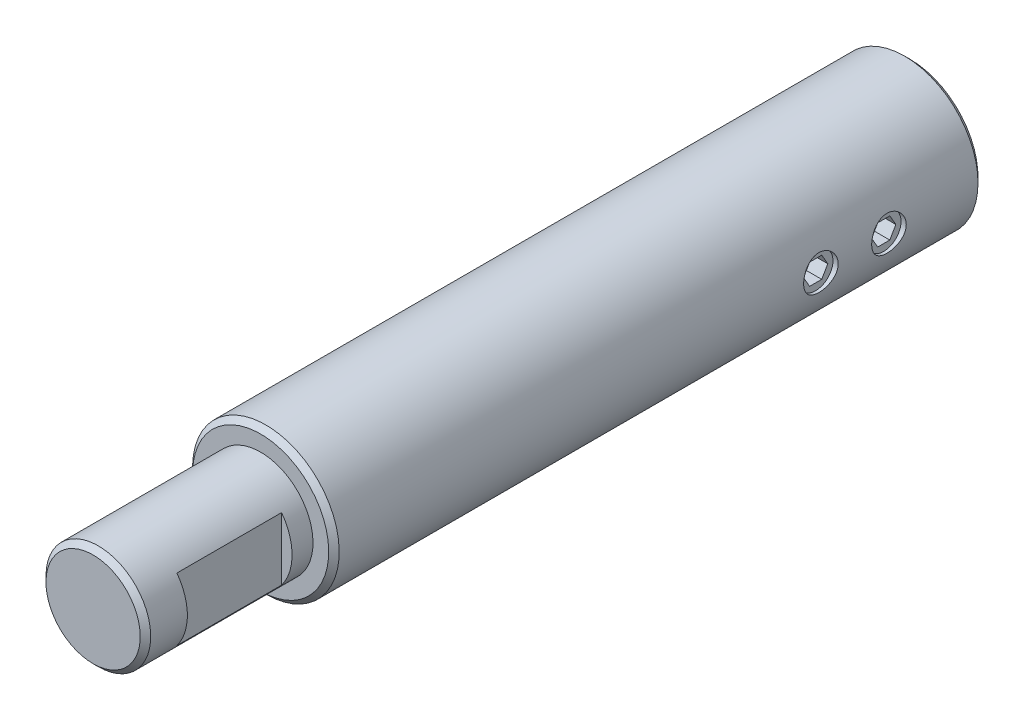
ISO-10303-21;
HEADER;
FILE_DESCRIPTION(('STEP AP214'),'2;1');
FILE_NAME('part.step','',(''),(''),'','','');
FILE_SCHEMA(('AUTOMOTIVE_DESIGN { 1 0 10303 214 1 1 1 1 }'));
ENDSEC;
DATA;
#1=APPLICATION_CONTEXT('core data for automotive mechanical design processes');
#2=APPLICATION_PROTOCOL_DEFINITION('international standard','automotive_design',2000,#1);
#3=PRODUCT_CONTEXT('',#1,'mechanical');
#4=PRODUCT('Part','Part','',(#3));
#5=PRODUCT_RELATED_PRODUCT_CATEGORY('part','',(#4));
#6=PRODUCT_DEFINITION_FORMATION('','',#4);
#7=PRODUCT_DEFINITION_CONTEXT('part definition',#1,'design');
#8=PRODUCT_DEFINITION('design','',#6,#7);
#9=PRODUCT_DEFINITION_SHAPE('','',#8);
#10=(LENGTH_UNIT() NAMED_UNIT(*) SI_UNIT(.MILLI.,.METRE.));
#11=(NAMED_UNIT(*) PLANE_ANGLE_UNIT() SI_UNIT($,.RADIAN.));
#12=(NAMED_UNIT(*) SI_UNIT($,.STERADIAN.) SOLID_ANGLE_UNIT());
#13=UNCERTAINTY_MEASURE_WITH_UNIT(LENGTH_MEASURE(1.E-05),#10,'distance_accuracy_value','');
#14=(GEOMETRIC_REPRESENTATION_CONTEXT(3) GLOBAL_UNCERTAINTY_ASSIGNED_CONTEXT((#13)) GLOBAL_UNIT_ASSIGNED_CONTEXT((#10,
#11,#12)) REPRESENTATION_CONTEXT('',''));
#15=CARTESIAN_POINT('',(0.,0.,0.));
#16=DIRECTION('',(0.,0.,1.));
#17=DIRECTION('',(1.,0.,0.));
#18=AXIS2_PLACEMENT_3D('',#15,#16,#17);
#19=CARTESIAN_POINT('',(5.,0.,10.1547005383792));
#20=DIRECTION('',(1.,0.,0.));
#21=DIRECTION('',(0.,1.,0.));
#22=AXIS2_PLACEMENT_3D('',#19,#20,#21);
#23=PLANE('',#22);
#24=DIRECTION('',(0.,-0.866025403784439,0.5));
#25=VECTOR('',#24,1.);
#26=CARTESIAN_POINT('',(5.,1.,9.57735026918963));
#27=LINE('',#26,#25);
#28=CARTESIAN_POINT('',(5.,1.,9.57735026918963));
#29=VERTEX_POINT('',#28);
#30=CARTESIAN_POINT('',(5.,0.,10.1547005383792));
#31=VERTEX_POINT('',#30);
#32=EDGE_CURVE('E96',#29,#31,#27,.T.);
#33=ORIENTED_EDGE('',*,*,#32,.T.);
#34=DIRECTION('',(0.,-0.866025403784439,-0.5));
#35=VECTOR('',#34,1.);
#36=CARTESIAN_POINT('',(5.,0.,10.1547005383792));
#37=LINE('',#36,#35);
#38=CARTESIAN_POINT('',(5.,-1.,9.57735026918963));
#39=VERTEX_POINT('',#38);
#40=EDGE_CURVE('E732',#31,#39,#37,.T.);
#41=ORIENTED_EDGE('',*,*,#40,.T.);
#42=DIRECTION('',(0.,0.,-1.));
#43=VECTOR('',#42,1.);
#44=CARTESIAN_POINT('',(5.,-1.,9.57735026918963));
#45=LINE('',#44,#43);
#46=CARTESIAN_POINT('',(5.,-1.,8.42264973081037));
#47=VERTEX_POINT('',#46);
#48=EDGE_CURVE('E728',#39,#47,#45,.T.);
#49=ORIENTED_EDGE('',*,*,#48,.T.);
#50=DIRECTION('',(0.,0.866025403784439,-0.5));
#51=VECTOR('',#50,1.);
#52=CARTESIAN_POINT('',(5.,-1.,8.42264973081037));
#53=LINE('',#52,#51);
#54=CARTESIAN_POINT('',(5.,0.,7.84529946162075));
#55=VERTEX_POINT('',#54);
#56=EDGE_CURVE('E731',#47,#55,#53,.T.);
#57=ORIENTED_EDGE('',*,*,#56,.T.);
#58=DIRECTION('',(0.,0.866025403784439,0.5));
#59=VECTOR('',#58,1.);
#60=CARTESIAN_POINT('',(5.,0.,7.84529946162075));
#61=LINE('',#60,#59);
#62=CARTESIAN_POINT('',(5.,1.,8.42264973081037));
#63=VERTEX_POINT('',#62);
#64=EDGE_CURVE('E736',#55,#63,#61,.T.);
#65=ORIENTED_EDGE('',*,*,#64,.T.);
#66=DIRECTION('',(0.,0.,1.));
#67=VECTOR('',#66,1.);
#68=CARTESIAN_POINT('',(5.,1.,8.42264973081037));
#69=LINE('',#68,#67);
#70=EDGE_CURVE('E121',#63,#29,#69,.T.);
#71=ORIENTED_EDGE('',*,*,#70,.T.);
#72=EDGE_LOOP('',(#33,#41,#49,#57,#65,#71));
#73=FACE_BOUND('',#72,.T.);
#74=ADVANCED_FACE('F14',(#73),#23,.T.);
#75=CARTESIAN_POINT('',(5.,0.,10.1547005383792));
#76=DIRECTION('',(0.,-0.5,0.866025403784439));
#77=DIRECTION('',(0.,-0.866025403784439,-0.5));
#78=AXIS2_PLACEMENT_3D('',#75,#76,#77);
#79=PLANE('',#78);
#80=DIRECTION('',(0.,-0.866025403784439,-0.5));
#81=VECTOR('',#80,1.);
#82=CARTESIAN_POINT('',(6.5,0.,10.1547005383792));
#83=LINE('',#82,#81);
#84=CARTESIAN_POINT('',(6.5,0.,10.1547005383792));
#85=VERTEX_POINT('',#84);
#86=CARTESIAN_POINT('',(6.5,-1.,9.57735026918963));
#87=VERTEX_POINT('',#86);
#88=EDGE_CURVE('E116',#85,#87,#83,.T.);
#89=ORIENTED_EDGE('',*,*,#88,.T.);
#90=DIRECTION('',(1.,0.,0.));
#91=VECTOR('',#90,1.);
#92=CARTESIAN_POINT('',(5.,-1.,9.57735026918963));
#93=LINE('',#92,#91);
#94=EDGE_CURVE('E135',#39,#87,#93,.T.);
#95=ORIENTED_EDGE('',*,*,#94,.F.);
#96=ORIENTED_EDGE('',*,*,#40,.F.);
#97=DIRECTION('',(1.,0.,0.));
#98=VECTOR('',#97,1.);
#99=CARTESIAN_POINT('',(5.,0.,10.1547005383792));
#100=LINE('',#99,#98);
#101=EDGE_CURVE('E137',#31,#85,#100,.T.);
#102=ORIENTED_EDGE('',*,*,#101,.T.);
#103=EDGE_LOOP('',(#89,#95,#96,#102));
#104=FACE_BOUND('',#103,.T.);
#105=ADVANCED_FACE('F443',(#104),#79,.F.);
#106=CARTESIAN_POINT('',(5.,-1.,9.57735026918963));
#107=DIRECTION('',(0.,-1.,0.));
#108=DIRECTION('',(1.,0.,0.));
#109=AXIS2_PLACEMENT_3D('',#106,#107,#108);
#110=PLANE('',#109);
#111=DIRECTION('',(0.,0.,-1.));
#112=VECTOR('',#111,1.);
#113=CARTESIAN_POINT('',(6.5,-1.,9.57735026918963));
#114=LINE('',#113,#112);
#115=CARTESIAN_POINT('',(6.5,-1.,8.42264973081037));
#116=VERTEX_POINT('',#115);
#117=EDGE_CURVE('E118',#87,#116,#114,.T.);
#118=ORIENTED_EDGE('',*,*,#117,.T.);
#119=DIRECTION('',(1.,0.,0.));
#120=VECTOR('',#119,1.);
#121=CARTESIAN_POINT('',(5.,-1.,8.42264973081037));
#122=LINE('',#121,#120);
#123=EDGE_CURVE('E133',#47,#116,#122,.T.);
#124=ORIENTED_EDGE('',*,*,#123,.F.);
#125=ORIENTED_EDGE('',*,*,#48,.F.);
#126=ORIENTED_EDGE('',*,*,#94,.T.);
#127=EDGE_LOOP('',(#118,#124,#125,#126));
#128=FACE_BOUND('',#127,.T.);
#129=ADVANCED_FACE('F454',(#128),#110,.F.);
#130=CARTESIAN_POINT('',(5.,-1.,8.42264973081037));
#131=DIRECTION('',(0.,-0.5,-0.866025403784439));
#132=DIRECTION('',(0.,0.866025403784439,-0.5));
#133=AXIS2_PLACEMENT_3D('',#130,#131,#132);
#134=PLANE('',#133);
#135=DIRECTION('',(0.,0.866025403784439,-0.5));
#136=VECTOR('',#135,1.);
#137=CARTESIAN_POINT('',(6.5,-1.,8.42264973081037));
#138=LINE('',#137,#136);
#139=CARTESIAN_POINT('',(6.5,0.,7.84529946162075));
#140=VERTEX_POINT('',#139);
#141=EDGE_CURVE('E126',#116,#140,#138,.T.);
#142=ORIENTED_EDGE('',*,*,#141,.T.);
#143=DIRECTION('',(1.,0.,0.));
#144=VECTOR('',#143,1.);
#145=CARTESIAN_POINT('',(5.,0.,7.84529946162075));
#146=LINE('',#145,#144);
#147=EDGE_CURVE('E131',#55,#140,#146,.T.);
#148=ORIENTED_EDGE('',*,*,#147,.F.);
#149=ORIENTED_EDGE('',*,*,#56,.F.);
#150=ORIENTED_EDGE('',*,*,#123,.T.);
#151=EDGE_LOOP('',(#142,#148,#149,#150));
#152=FACE_BOUND('',#151,.T.);
#153=ADVANCED_FACE('F450',(#152),#134,.F.);
#154=CARTESIAN_POINT('',(5.,0.,7.84529946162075));
#155=DIRECTION('',(0.,0.5,-0.866025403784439));
#156=DIRECTION('',(0.,0.866025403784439,0.5));
#157=AXIS2_PLACEMENT_3D('',#154,#155,#156);
#158=PLANE('',#157);
#159=DIRECTION('',(0.,0.866025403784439,0.5));
#160=VECTOR('',#159,1.);
#161=CARTESIAN_POINT('',(6.5,0.,7.84529946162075));
#162=LINE('',#161,#160);
#163=CARTESIAN_POINT('',(6.5,1.,8.42264973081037));
#164=VERTEX_POINT('',#163);
#165=EDGE_CURVE('E109',#140,#164,#162,.T.);
#166=ORIENTED_EDGE('',*,*,#165,.T.);
#167=DIRECTION('',(1.,0.,0.));
#168=VECTOR('',#167,1.);
#169=CARTESIAN_POINT('',(5.,1.,8.42264973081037));
#170=LINE('',#169,#168);
#171=EDGE_CURVE('E101',#63,#164,#170,.T.);
#172=ORIENTED_EDGE('',*,*,#171,.F.);
#173=ORIENTED_EDGE('',*,*,#64,.F.);
#174=ORIENTED_EDGE('',*,*,#147,.T.);
#175=EDGE_LOOP('',(#166,#172,#173,#174));
#176=FACE_BOUND('',#175,.T.);
#177=ADVANCED_FACE('F447',(#176),#158,.F.);
#178=CARTESIAN_POINT('',(5.,1.,8.42264973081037));
#179=DIRECTION('',(0.,1.,0.));
#180=DIRECTION('',(-1.,0.,0.));
#181=AXIS2_PLACEMENT_3D('',#178,#179,#180);
#182=PLANE('',#181);
#183=DIRECTION('',(0.,0.,1.));
#184=VECTOR('',#183,1.);
#185=CARTESIAN_POINT('',(6.5,1.,8.42264973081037));
#186=LINE('',#185,#184);
#187=CARTESIAN_POINT('',(6.5,1.,9.57735026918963));
#188=VERTEX_POINT('',#187);
#189=EDGE_CURVE('E104',#164,#188,#186,.T.);
#190=ORIENTED_EDGE('',*,*,#189,.T.);
#191=DIRECTION('',(1.,0.,0.));
#192=VECTOR('',#191,1.);
#193=CARTESIAN_POINT('',(5.,1.,9.57735026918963));
#194=LINE('',#193,#192);
#195=EDGE_CURVE('E89',#29,#188,#194,.T.);
#196=ORIENTED_EDGE('',*,*,#195,.F.);
#197=ORIENTED_EDGE('',*,*,#70,.F.);
#198=ORIENTED_EDGE('',*,*,#171,.T.);
#199=EDGE_LOOP('',(#190,#196,#197,#198));
#200=FACE_BOUND('',#199,.T.);
#201=ADVANCED_FACE('F105',(#200),#182,.F.);
#202=CARTESIAN_POINT('',(5.,1.,9.57735026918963));
#203=DIRECTION('',(0.,0.5,0.866025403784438));
#204=DIRECTION('',(0.,-0.866025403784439,0.5));
#205=AXIS2_PLACEMENT_3D('',#202,#203,#204);
#206=PLANE('',#205);
#207=DIRECTION('',(0.,-0.866025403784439,0.5));
#208=VECTOR('',#207,1.);
#209=CARTESIAN_POINT('',(6.5,1.,9.57735026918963));
#210=LINE('',#209,#208);
#211=EDGE_CURVE('E93',#188,#85,#210,.T.);
#212=ORIENTED_EDGE('',*,*,#211,.T.);
#213=ORIENTED_EDGE('',*,*,#101,.F.);
#214=ORIENTED_EDGE('',*,*,#32,.F.);
#215=ORIENTED_EDGE('',*,*,#195,.T.);
#216=EDGE_LOOP('',(#212,#213,#214,#215));
#217=FACE_BOUND('',#216,.T.);
#218=ADVANCED_FACE('F91',(#217),#206,.F.);
#219=CARTESIAN_POINT('',(6.5,0.,11.));
#220=DIRECTION('',(1.,0.,0.));
#221=DIRECTION('',(0.,0.,-1.));
#222=AXIS2_PLACEMENT_3D('',#219,#220,#221);
#223=PLANE('',#222);
#224=ORIENTED_EDGE('',*,*,#211,.F.);
#225=ORIENTED_EDGE('',*,*,#189,.F.);
#226=ORIENTED_EDGE('',*,*,#165,.F.);
#227=ORIENTED_EDGE('',*,*,#141,.F.);
#228=ORIENTED_EDGE('',*,*,#117,.F.);
#229=ORIENTED_EDGE('',*,*,#88,.F.);
#230=EDGE_LOOP('',(#224,#225,#226,#227,#228,#229));
#231=FACE_BOUND('',#230,.T.);
#232=CARTESIAN_POINT('',(6.5,0.,9.));
#233=DIRECTION('',(1.,0.,0.));
#234=DIRECTION('',(0.,0.,1.));
#235=AXIS2_PLACEMENT_3D('',#232,#233,#234);
#236=CIRCLE('',#235,1.65);
#237=CARTESIAN_POINT('',(6.5,0.,10.65));
#238=VERTEX_POINT('',#237);
#239=EDGE_CURVE('E374',#238,#238,#236,.F.);
#240=ORIENTED_EDGE('',*,*,#239,.F.);
#241=EDGE_LOOP('',(#240));
#242=FACE_BOUND('',#241,.T.);
#243=ADVANCED_FACE('F112',(#231,#242),#223,.T.);
#244=CARTESIAN_POINT('',(2.5,0.,9.));
#245=DIRECTION('',(-1.,0.,0.));
#246=DIRECTION('',(0.,0.,1.));
#247=AXIS2_PLACEMENT_3D('',#244,#245,#246);
#248=CYLINDRICAL_SURFACE('',#247,2.);
#249=CARTESIAN_POINT('',(3.25,0.,9.));
#250=DIRECTION('',(-1.,0.,0.));
#251=DIRECTION('',(0.,0.,1.));
#252=AXIS2_PLACEMENT_3D('',#249,#250,#251);
#253=CIRCLE('',#252,2.);
#254=CARTESIAN_POINT('',(3.25,0.,11.));
#255=VERTEX_POINT('',#254);
#256=EDGE_CURVE('E100',#255,#255,#253,.T.);
#257=ORIENTED_EDGE('',*,*,#256,.F.);
#258=EDGE_LOOP('',(#257));
#259=FACE_BOUND('',#258,.T.);
#260=CARTESIAN_POINT('',(4.,0.,11.));
#261=CARTESIAN_POINT('',(3.99999426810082,-0.105143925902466,10.9999933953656));
#262=CARTESIAN_POINT('',(3.99580982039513,-0.210413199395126,10.9916598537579));
#263=CARTESIAN_POINT('',(3.97948312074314,-0.417840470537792,10.9586942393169));
#264=CARTESIAN_POINT('',(3.96732575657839,-0.519992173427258,10.9340312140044));
#265=CARTESIAN_POINT('',(3.93632558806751,-0.717867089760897,10.8696123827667));
#266=CARTESIAN_POINT('',(3.91750878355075,-0.813613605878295,10.8299152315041));
#267=CARTESIAN_POINT('',(3.87491553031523,-0.9969452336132,10.73685875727));
#268=CARTESIAN_POINT('',(3.85113947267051,-1.08453098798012,10.6835005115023));
#269=CARTESIAN_POINT('',(3.79912516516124,-1.25501563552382,10.5609655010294));
#270=CARTESIAN_POINT('',(3.77070398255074,-1.33731042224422,10.4910270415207));
#271=CARTESIAN_POINT('',(3.71319940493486,-1.48955888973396,10.3389570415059));
#272=CARTESIAN_POINT('',(3.68411552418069,-1.55950316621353,10.2568162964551));
#273=CARTESIAN_POINT('',(3.62597902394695,-1.69050400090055,10.0750333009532));
#274=CARTESIAN_POINT('',(3.59710373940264,-1.75045067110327,9.97452780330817));
#275=CARTESIAN_POINT('',(3.54571957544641,-1.85233645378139,9.76326532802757));
#276=CARTESIAN_POINT('',(3.52320615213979,-1.89428842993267,9.6525157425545));
#277=CARTESIAN_POINT('',(3.48915734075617,-1.95626488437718,9.43066978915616));
#278=CARTESIAN_POINT('',(3.47704543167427,-1.97745171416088,9.31999109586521));
#279=CARTESIAN_POINT('',(3.46363779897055,-2.00085398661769,9.09604232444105));
#280=CARTESIAN_POINT('',(3.46233138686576,-2.00308817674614,8.98277491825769));
#281=CARTESIAN_POINT('',(3.47021860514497,-1.98937457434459,8.77142795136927));
#282=CARTESIAN_POINT('',(3.47817527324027,-1.97556911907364,8.6731519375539));
#283=CARTESIAN_POINT('',(3.50152457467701,-1.93387969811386,8.48055618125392));
#284=CARTESIAN_POINT('',(3.51691957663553,-1.9059912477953,8.38623770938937));
#285=CARTESIAN_POINT('',(3.55374952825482,-1.83641956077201,8.20154173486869));
#286=CARTESIAN_POINT('',(3.57531681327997,-1.79443013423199,8.11130720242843));
#287=CARTESIAN_POINT('',(3.62206808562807,-1.69808337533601,7.93873141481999));
#288=CARTESIAN_POINT('',(3.64725369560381,-1.64372048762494,7.85639372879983));
#289=CARTESIAN_POINT('',(3.70226315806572,-1.51613210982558,7.69095749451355));
#290=CARTESIAN_POINT('',(3.73227020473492,-1.44138891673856,7.60908625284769));
#291=CARTESIAN_POINT('',(3.79095246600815,-1.27911115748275,7.4585291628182));
#292=CARTESIAN_POINT('',(3.81962703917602,-1.19157051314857,7.38984961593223));
#293=CARTESIAN_POINT('',(3.87403974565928,-1.0010330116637,7.26462867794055));
#294=CARTESIAN_POINT('',(3.89957968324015,-0.897507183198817,7.20879905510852));
#295=CARTESIAN_POINT('',(3.94315762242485,-0.680932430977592,7.11580594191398));
#296=CARTESIAN_POINT('',(3.96120157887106,-0.567891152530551,7.07862762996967));
#297=CARTESIAN_POINT('',(3.98648667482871,-0.345532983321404,7.02704919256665));
#298=CARTESIAN_POINT('',(3.9944987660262,-0.236683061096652,7.01101752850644));
#299=CARTESIAN_POINT('',(4.00146026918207,-0.0175591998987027,6.99707053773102));
#300=CARTESIAN_POINT('',(4.00041397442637,0.0927140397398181,6.99914662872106));
#301=CARTESIAN_POINT('',(3.9898238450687,0.302465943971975,7.02041337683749));
#302=CARTESIAN_POINT('',(3.98094491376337,0.402118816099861,7.03826506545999));
#303=CARTESIAN_POINT('',(3.95644342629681,0.596813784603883,7.08847614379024));
#304=CARTESIAN_POINT('',(3.94082012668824,0.691855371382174,7.12083713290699));
#305=CARTESIAN_POINT('',(3.90368502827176,0.877777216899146,7.19999693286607));
#306=CARTESIAN_POINT('',(3.88201763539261,0.968460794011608,7.24718210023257));
#307=CARTESIAN_POINT('',(3.83487948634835,1.14092272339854,7.35421507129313));
#308=CARTESIAN_POINT('',(3.80940711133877,1.22269725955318,7.41406826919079));
#309=CARTESIAN_POINT('',(3.75416442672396,1.38353537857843,7.55152085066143));
#310=CARTESIAN_POINT('',(3.72421769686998,1.46154415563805,7.63028573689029));
#311=CARTESIAN_POINT('',(3.6652478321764,1.60371264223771,7.79985030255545));
#312=CARTESIAN_POINT('',(3.63622534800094,1.66786277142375,7.89065823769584));
#313=CARTESIAN_POINT('',(3.58102384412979,1.78341582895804,8.08728730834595));
#314=CARTESIAN_POINT('',(3.55505059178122,1.8340509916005,8.19362253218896));
#315=CARTESIAN_POINT('',(3.51148144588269,1.91616565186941,8.41502013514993));
#316=CARTESIAN_POINT('',(3.493874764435,1.94766983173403,8.53007105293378));
#317=CARTESIAN_POINT('',(3.47123002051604,1.98772337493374,8.75382044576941));
#318=CARTESIAN_POINT('',(3.4651476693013,1.9981859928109,8.86206850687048));
#319=CARTESIAN_POINT('',(3.46330709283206,2.00137830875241,9.07889413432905));
#320=CARTESIAN_POINT('',(3.4675443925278,1.99411569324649,9.18747153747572));
#321=CARTESIAN_POINT('',(3.48475724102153,1.96385225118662,9.39096700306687));
#322=CARTESIAN_POINT('',(3.49686188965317,1.94241662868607,9.48620094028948));
#323=CARTESIAN_POINT('',(3.52742032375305,1.88635071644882,9.67161623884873));
#324=CARTESIAN_POINT('',(3.54587615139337,1.85171618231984,9.76179596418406));
#325=CARTESIAN_POINT('',(3.58857060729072,1.76763149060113,9.94124970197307));
#326=CARTESIAN_POINT('',(3.61311444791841,1.7173422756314,10.0300558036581));
#327=CARTESIAN_POINT('',(3.66470663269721,1.60430194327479,10.1985490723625));
#328=CARTESIAN_POINT('',(3.69175627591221,1.54154434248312,10.2782314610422));
#329=CARTESIAN_POINT('',(3.74924646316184,1.39640665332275,10.4362839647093));
#330=CARTESIAN_POINT('',(3.77969966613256,1.31256884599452,10.5133182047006));
#331=CARTESIAN_POINT('',(3.83755504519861,1.1323096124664,10.6525259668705));
#332=CARTESIAN_POINT('',(3.8649555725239,1.0358814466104,10.7146914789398));
#333=CARTESIAN_POINT('',(3.91396019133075,0.83186319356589,10.8224727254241));
#334=CARTESIAN_POINT('',(3.93552192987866,0.724199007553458,10.8679683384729));
#335=CARTESIAN_POINT('',(3.97002682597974,0.501484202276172,10.9396163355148));
#336=CARTESIAN_POINT('',(3.98299446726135,0.386455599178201,10.9658236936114));
#337=CARTESIAN_POINT('',(3.99390923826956,0.225203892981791,10.9877948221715));
#338=CARTESIAN_POINT('',(3.99618730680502,0.180323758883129,10.9923652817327));
#339=CARTESIAN_POINT('',(3.99923393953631,0.090303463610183,10.9984693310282));
#340=CARTESIAN_POINT('',(4.00000246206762,0.0451632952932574,11.0000028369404));
#341=CARTESIAN_POINT('',(4.,0.,11.));
#342=B_SPLINE_CURVE_WITH_KNOTS('',3,(#260,#261,#262,#263,#264,#265,#266,#267,#268,#269,#270,
#271,#272,#273,#274,#275,#276,#277,#278,#279,#280,#281,#282,#283,#284,#285,#286,#287,#288,#289,
#290,#291,#292,#293,#294,#295,#296,#297,#298,#299,#300,#301,#302,#303,#304,#305,#306,#307,#308,
#309,#310,#311,#312,#313,#314,#315,#316,#317,#318,#319,#320,#321,#322,#323,#324,#325,#326,#327,
#328,#329,#330,#331,#332,#333,#334,#335,#336,#337,#338,#339,#340,#341),.UNSPECIFIED.,.T.,.F.,(4,
2,2,2,2,2,2,2,2,2,2,2,2,2,2,2,2,2,2,2,2,2,2,2,2,2,2,2,2,2,2,2,2,2,2,2,2,2,2,2,4),(0.,
0.315248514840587,0.631096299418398,0.945724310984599,1.26032752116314,1.59396351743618,
1.92785247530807,2.28763452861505,2.64715895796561,2.98516024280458,3.3228271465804,
3.62011424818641,3.91749607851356,4.22180480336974,4.52625042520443,4.86929882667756,
5.21251069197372,5.57166044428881,5.93052433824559,6.25966580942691,6.58865129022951,
6.89213813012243,7.19565843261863,7.50785712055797,7.82018901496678,8.16319221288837,
8.50643177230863,8.86629364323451,9.22569023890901,9.55058615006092,9.87534119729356,
10.1691586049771,10.463070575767,10.7767291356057,11.0905512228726,11.4425048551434,
11.7946476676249,12.1492802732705,12.502898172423,12.6383056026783,12.7737167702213),.UNSPECIFIED.);
#343=CARTESIAN_POINT('',(4.,0.,11.));
#344=VERTEX_POINT('',#343);
#345=EDGE_CURVE('E203',#344,#344,#342,.T.);
#346=ORIENTED_EDGE('',*,*,#345,.F.);
#347=EDGE_LOOP('',(#346));
#348=FACE_BOUND('',#347,.T.);
#349=ADVANCED_FACE('F465',(#259,#348),#248,.T.);
#350=CARTESIAN_POINT('',(2.5,0.,9.));
#351=DIRECTION('',(-1.,0.,0.));
#352=DIRECTION('',(0.,0.,1.));
#353=AXIS2_PLACEMENT_3D('',#350,#351,#352);
#354=PLANE('',#353);
#355=CARTESIAN_POINT('',(2.5,0.,9.));
#356=DIRECTION('',(-1.,0.,0.));
#357=DIRECTION('',(0.,0.,1.));
#358=AXIS2_PLACEMENT_3D('',#355,#356,#357);
#359=CIRCLE('',#358,1.25);
#360=CARTESIAN_POINT('',(2.5,0.,10.25));
#361=VERTEX_POINT('',#360);
#362=EDGE_CURVE('E18',#361,#361,#359,.T.);
#363=ORIENTED_EDGE('',*,*,#362,.T.);
#364=EDGE_LOOP('',(#363));
#365=FACE_BOUND('',#364,.T.);
#366=ADVANCED_FACE('F16',(#365),#354,.T.);
#367=CARTESIAN_POINT('',(2.5,0.,9.));
#368=DIRECTION('',(1.,0.,0.));
#369=DIRECTION('',(0.,0.,-1.));
#370=AXIS2_PLACEMENT_3D('',#367,#368,#369);
#371=CONICAL_SURFACE('',#370,1.25,0.78539816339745);
#372=ORIENTED_EDGE('',*,*,#256,.T.);
#373=EDGE_LOOP('',(#372));
#374=FACE_BOUND('',#373,.T.);
#375=ORIENTED_EDGE('',*,*,#362,.F.);
#376=EDGE_LOOP('',(#375));
#377=FACE_BOUND('',#376,.T.);
#378=ADVANCED_FACE('F224',(#374,#377),#371,.T.);
#379=CARTESIAN_POINT('',(-5.,0.,78.));
#380=DIRECTION('',(0.,0.,-1.));
#381=DIRECTION('',(0.,-1.,0.));
#382=AXIS2_PLACEMENT_3D('',#379,#380,#381);
#383=PLANE('',#382);
#384=CARTESIAN_POINT('',(0.,0.,78.));
#385=DIRECTION('',(0.,0.,-1.));
#386=DIRECTION('',(0.,-1.,0.));
#387=AXIS2_PLACEMENT_3D('',#384,#385,#386);
#388=CIRCLE('',#387,4.5);
#389=CARTESIAN_POINT('',(0.,-4.5,78.));
#390=VERTEX_POINT('',#389);
#391=EDGE_CURVE('E378',#390,#390,#388,.F.);
#392=ORIENTED_EDGE('',*,*,#391,.T.);
#393=EDGE_LOOP('',(#392));
#394=FACE_BOUND('',#393,.T.);
#395=ADVANCED_FACE('F240',(#394),#383,.F.);
#396=CARTESIAN_POINT('',(0.,0.,74.));
#397=DIRECTION('',(0.,0.,1.));
#398=DIRECTION('',(0.,1.,0.));
#399=AXIS2_PLACEMENT_3D('',#396,#397,#398);
#400=PLANE('',#399);
#401=CARTESIAN_POINT('',(0.,0.,74.));
#402=DIRECTION('',(0.,0.,1.));
#403=DIRECTION('',(0.,1.,0.));
#404=AXIS2_PLACEMENT_3D('',#401,#402,#403);
#405=CIRCLE('',#404,5.);
#406=CARTESIAN_POINT('',(4.,-3.,74.));
#407=VERTEX_POINT('',#406);
#408=CARTESIAN_POINT('',(4.,3.,74.));
#409=VERTEX_POINT('',#408);
#410=EDGE_CURVE('E142',#407,#409,#405,.T.);
#411=ORIENTED_EDGE('',*,*,#410,.F.);
#412=DIRECTION('',(0.,-1.,0.));
#413=VECTOR('',#412,1.);
#414=CARTESIAN_POINT('',(4.,-3.,74.));
#415=LINE('',#414,#413);
#416=EDGE_CURVE('E146',#409,#407,#415,.T.);
#417=ORIENTED_EDGE('',*,*,#416,.F.);
#418=EDGE_LOOP('',(#411,#417));
#419=FACE_BOUND('',#418,.T.);
#420=ADVANCED_FACE('F238',(#419),#400,.F.);
#421=CARTESIAN_POINT('',(4.,-3.,64.));
#422=DIRECTION('',(-1.,0.,0.));
#423=DIRECTION('',(0.,-1.,0.));
#424=AXIS2_PLACEMENT_3D('',#421,#422,#423);
#425=PLANE('',#424);
#426=ORIENTED_EDGE('',*,*,#416,.T.);
#427=DIRECTION('',(0.,0.,1.));
#428=VECTOR('',#427,1.);
#429=CARTESIAN_POINT('',(4.,-3.,64.));
#430=LINE('',#429,#428);
#431=CARTESIAN_POINT('',(4.,-3.,64.));
#432=VERTEX_POINT('',#431);
#433=EDGE_CURVE('E158',#432,#407,#430,.T.);
#434=ORIENTED_EDGE('',*,*,#433,.F.);
#435=DIRECTION('',(0.,-1.,0.));
#436=VECTOR('',#435,1.);
#437=CARTESIAN_POINT('',(4.,-3.,64.));
#438=LINE('',#437,#436);
#439=CARTESIAN_POINT('',(4.,3.,64.));
#440=VERTEX_POINT('',#439);
#441=EDGE_CURVE('E155',#440,#432,#438,.T.);
#442=ORIENTED_EDGE('',*,*,#441,.F.);
#443=DIRECTION('',(0.,0.,1.));
#444=VECTOR('',#443,1.);
#445=CARTESIAN_POINT('',(4.,3.,64.));
#446=LINE('',#445,#444);
#447=EDGE_CURVE('E161',#440,#409,#446,.T.);
#448=ORIENTED_EDGE('',*,*,#447,.T.);
#449=EDGE_LOOP('',(#426,#434,#442,#448));
#450=FACE_BOUND('',#449,.T.);
#451=ADVANCED_FACE('F187',(#450),#425,.F.);
#452=CARTESIAN_POINT('',(0.,0.,64.));
#453=DIRECTION('',(0.,0.,1.));
#454=DIRECTION('',(0.,1.,0.));
#455=AXIS2_PLACEMENT_3D('',#452,#453,#454);
#456=PLANE('',#455);
#457=CARTESIAN_POINT('',(0.,0.,64.));
#458=DIRECTION('',(0.,0.,1.));
#459=DIRECTION('',(0.,1.,0.));
#460=AXIS2_PLACEMENT_3D('',#457,#458,#459);
#461=CIRCLE('',#460,5.);
#462=EDGE_CURVE('E152',#432,#440,#461,.T.);
#463=ORIENTED_EDGE('',*,*,#462,.T.);
#464=ORIENTED_EDGE('',*,*,#441,.T.);
#465=EDGE_LOOP('',(#463,#464));
#466=FACE_BOUND('',#465,.T.);
#467=ADVANCED_FACE('F234',(#466),#456,.T.);
#468=CARTESIAN_POINT('',(0.,0.,77.5));
#469=DIRECTION('',(0.,0.,-1.));
#470=DIRECTION('',(0.,-1.,0.));
#471=AXIS2_PLACEMENT_3D('',#468,#469,#470);
#472=CONICAL_SURFACE('',#471,5.,0.785398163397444);
#473=ORIENTED_EDGE('',*,*,#391,.F.);
#474=EDGE_LOOP('',(#473));
#475=FACE_BOUND('',#474,.T.);
#476=CARTESIAN_POINT('',(0.,0.,77.5));
#477=DIRECTION('',(0.,0.,-1.));
#478=DIRECTION('',(0.,-1.,0.));
#479=AXIS2_PLACEMENT_3D('',#476,#477,#478);
#480=CIRCLE('',#479,5.);
#481=CARTESIAN_POINT('',(0.,-5.,77.5));
#482=VERTEX_POINT('',#481);
#483=EDGE_CURVE('E381',#482,#482,#480,.T.);
#484=ORIENTED_EDGE('',*,*,#483,.F.);
#485=EDGE_LOOP('',(#484));
#486=FACE_BOUND('',#485,.T.);
#487=ADVANCED_FACE('F236',(#475,#486),#472,.T.);
#488=CARTESIAN_POINT('',(0.,0.,0.));
#489=DIRECTION('',(0.,0.,-1.));
#490=DIRECTION('',(0.,-1.,0.));
#491=AXIS2_PLACEMENT_3D('',#488,#489,#490);
#492=CYLINDRICAL_SURFACE('',#491,5.);
#493=ORIENTED_EDGE('',*,*,#483,.T.);
#494=EDGE_LOOP('',(#493));
#495=FACE_BOUND('',#494,.T.);
#496=CARTESIAN_POINT('',(0.,0.,62.));
#497=DIRECTION('',(0.,0.,-1.));
#498=DIRECTION('',(0.,-1.,0.));
#499=AXIS2_PLACEMENT_3D('',#496,#497,#498);
#500=CIRCLE('',#499,5.);
#501=CARTESIAN_POINT('',(0.,-5.,62.));
#502=VERTEX_POINT('',#501);
#503=EDGE_CURVE('E404',#502,#502,#500,.T.);
#504=ORIENTED_EDGE('',*,*,#503,.F.);
#505=EDGE_LOOP('',(#504));
#506=FACE_BOUND('',#505,.T.);
#507=ORIENTED_EDGE('',*,*,#462,.F.);
#508=ORIENTED_EDGE('',*,*,#433,.T.);
#509=ORIENTED_EDGE('',*,*,#410,.T.);
#510=ORIENTED_EDGE('',*,*,#447,.F.);
#511=EDGE_LOOP('',(#507,#508,#509,#510));
#512=FACE_BOUND('',#511,.T.);
#513=ADVANCED_FACE('F439',(#495,#506,#512),#492,.T.);
#514=CARTESIAN_POINT('',(-7.,0.,62.));
#515=DIRECTION('',(0.,0.,-1.));
#516=DIRECTION('',(0.,-1.,0.));
#517=AXIS2_PLACEMENT_3D('',#514,#515,#516);
#518=PLANE('',#517);
#519=CARTESIAN_POINT('',(0.,0.,62.));
#520=DIRECTION('',(0.,0.,-1.));
#521=DIRECTION('',(0.,-1.,0.));
#522=AXIS2_PLACEMENT_3D('',#519,#520,#521);
#523=CIRCLE('',#522,6.5);
#524=CARTESIAN_POINT('',(0.,-6.5,62.));
#525=VERTEX_POINT('',#524);
#526=EDGE_CURVE('E386',#525,#525,#523,.F.);
#527=ORIENTED_EDGE('',*,*,#526,.T.);
#528=EDGE_LOOP('',(#527));
#529=FACE_BOUND('',#528,.T.);
#530=ORIENTED_EDGE('',*,*,#503,.T.);
#531=EDGE_LOOP('',(#530));
#532=FACE_BOUND('',#531,.T.);
#533=ADVANCED_FACE('F571',(#529,#532),#518,.F.);
#534=CARTESIAN_POINT('',(-4.,0.,0.));
#535=DIRECTION('',(0.,0.,1.));
#536=DIRECTION('',(0.,1.,0.));
#537=AXIS2_PLACEMENT_3D('',#534,#535,#536);
#538=PLANE('',#537);
#539=CARTESIAN_POINT('',(0.,0.,0.));
#540=DIRECTION('',(0.,0.,1.));
#541=DIRECTION('',(0.,1.,0.));
#542=AXIS2_PLACEMENT_3D('',#539,#540,#541);
#543=CIRCLE('',#542,6.5);
#544=CARTESIAN_POINT('',(0.,6.5,0.));
#545=VERTEX_POINT('',#544);
#546=EDGE_CURVE('E395',#545,#545,#543,.F.);
#547=ORIENTED_EDGE('',*,*,#546,.T.);
#548=EDGE_LOOP('',(#547));
#549=FACE_BOUND('',#548,.T.);
#550=CARTESIAN_POINT('',(0.,0.,0.));
#551=DIRECTION('',(0.,0.,1.));
#552=DIRECTION('',(0.,1.,0.));
#553=AXIS2_PLACEMENT_3D('',#550,#551,#552);
#554=CIRCLE('',#553,4.57735026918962);
#555=CARTESIAN_POINT('',(0.,4.57735026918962,0.));
#556=VERTEX_POINT('',#555);
#557=EDGE_CURVE('E398',#556,#556,#554,.T.);
#558=ORIENTED_EDGE('',*,*,#557,.T.);
#559=EDGE_LOOP('',(#558));
#560=FACE_BOUND('',#559,.T.);
#561=ADVANCED_FACE('F194',(#549,#560),#538,.F.);
#562=CARTESIAN_POINT('',(7.,0.,15.5));
#563=DIRECTION('',(1.,0.,0.));
#564=DIRECTION('',(0.,1.,0.));
#565=AXIS2_PLACEMENT_3D('',#562,#563,#564);
#566=CYLINDRICAL_SURFACE('',#565,1.65);
#567=CARTESIAN_POINT('',(6.5,0.,15.5));
#568=DIRECTION('',(1.,0.,0.));
#569=DIRECTION('',(0.,0.,1.));
#570=AXIS2_PLACEMENT_3D('',#567,#568,#569);
#571=CIRCLE('',#570,1.65);
#572=CARTESIAN_POINT('',(6.5,0.,17.15));
#573=VERTEX_POINT('',#572);
#574=EDGE_CURVE('E24',#573,#573,#571,.T.);
#575=ORIENTED_EDGE('',*,*,#574,.F.);
#576=EDGE_LOOP('',(#575));
#577=FACE_BOUND('',#576,.T.);
#578=CARTESIAN_POINT('',(6.80275679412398,1.65,15.5));
#579=CARTESIAN_POINT('',(6.80275861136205,1.64999713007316,15.4087109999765));
#580=CARTESIAN_POINT('',(6.80461440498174,1.64239813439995,15.3173890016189));
#581=CARTESIAN_POINT('',(6.81182064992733,1.61224414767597,15.137355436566));
#582=CARTESIAN_POINT('',(6.81717336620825,1.58967946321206,15.0486456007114));
#583=CARTESIAN_POINT('',(6.83073431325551,1.53035515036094,14.8764664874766));
#584=CARTESIAN_POINT('',(6.83893911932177,1.49361254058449,14.7929910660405));
#585=CARTESIAN_POINT('',(6.85727558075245,1.40702581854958,14.63338346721));
#586=CARTESIAN_POINT('',(6.86740726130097,1.3571815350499,14.5572513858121));
#587=CARTESIAN_POINT('',(6.88867782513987,1.24476461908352,14.4130001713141));
#588=CARTESIAN_POINT('',(6.89983131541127,1.18198309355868,14.3450459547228));
#589=CARTESIAN_POINT('',(6.92176152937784,1.04592427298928,14.2205282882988));
#590=CARTESIAN_POINT('',(6.93253822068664,0.972646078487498,14.1639658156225));
#591=CARTESIAN_POINT('',(6.95266103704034,0.816555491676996,14.0631730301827));
#592=CARTESIAN_POINT('',(6.96198791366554,0.733636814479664,14.0191031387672));
#593=CARTESIAN_POINT('',(6.97799434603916,0.561312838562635,13.9455870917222));
#594=CARTESIAN_POINT('',(6.98467424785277,0.471908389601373,13.9161390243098));
#595=CARTESIAN_POINT('',(6.99453084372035,0.290868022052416,13.8732262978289));
#596=CARTESIAN_POINT('',(6.99776875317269,0.199301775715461,13.859482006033));
#597=CARTESIAN_POINT('',(7.00058928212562,0.0151097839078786,13.8474908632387));
#598=CARTESIAN_POINT('',(7.00017238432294,-0.077515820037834,13.849241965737));
#599=CARTESIAN_POINT('',(6.99577641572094,-0.259263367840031,13.8679874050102));
#600=CARTESIAN_POINT('',(6.99186783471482,-0.348418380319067,13.8846801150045));
#601=CARTESIAN_POINT('',(6.98100889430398,-0.522624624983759,13.9323520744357));
#602=CARTESIAN_POINT('',(6.97405838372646,-0.607675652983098,13.9633320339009));
#603=CARTESIAN_POINT('',(6.95778608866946,-0.772074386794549,14.0389537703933));
#604=CARTESIAN_POINT('',(6.94844521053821,-0.851369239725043,14.0837061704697));
#605=CARTESIAN_POINT('',(6.92841069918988,-1.001431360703,14.185519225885));
#606=CARTESIAN_POINT('',(6.91771685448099,-1.07219729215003,14.242581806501));
#607=CARTESIAN_POINT('',(6.89584251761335,-1.20498965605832,14.369024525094));
#608=CARTESIAN_POINT('',(6.88465650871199,-1.26676421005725,14.4386684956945));
#609=CARTESIAN_POINT('',(6.8632971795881,-1.37780936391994,14.5874443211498));
#610=CARTESIAN_POINT('',(6.85312389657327,-1.42707950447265,14.6665765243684));
#611=CARTESIAN_POINT('',(6.83492437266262,-1.51185477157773,14.8325352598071));
#612=CARTESIAN_POINT('',(6.82690665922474,-1.54730546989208,14.9193905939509));
#613=CARTESIAN_POINT('',(6.8140390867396,-1.6030277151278,15.0980612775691));
#614=CARTESIAN_POINT('',(6.80918863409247,-1.62330210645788,15.1898756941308));
#615=CARTESIAN_POINT('',(6.80332774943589,-1.64769127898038,15.3735385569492));
#616=CARTESIAN_POINT('',(6.80222947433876,-1.65217579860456,15.4653351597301));
#617=CARTESIAN_POINT('',(6.80375919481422,-1.64586488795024,15.6483645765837));
#618=CARTESIAN_POINT('',(6.80638688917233,-1.63507069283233,15.7395974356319));
#619=CARTESIAN_POINT('',(6.81498886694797,-1.59883140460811,15.9175774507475));
#620=CARTESIAN_POINT('',(6.82091521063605,-1.57359604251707,16.0043698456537));
#621=CARTESIAN_POINT('',(6.83540229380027,-1.50942069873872,16.1724936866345));
#622=CARTESIAN_POINT('',(6.843963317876,-1.47047923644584,16.2538245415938));
#623=CARTESIAN_POINT('',(6.86294389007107,-1.37920410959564,16.4102990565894));
#624=CARTESIAN_POINT('',(6.87339357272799,-1.32664621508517,16.4853081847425));
#625=CARTESIAN_POINT('',(6.89489755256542,-1.20991829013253,16.6255780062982));
#626=CARTESIAN_POINT('',(6.90595193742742,-1.14574657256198,16.6908372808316));
#627=CARTESIAN_POINT('',(6.92771364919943,-1.00592681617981,16.8112229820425));
#628=CARTESIAN_POINT('',(6.93840801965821,-0.930057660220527,16.8660953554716));
#629=CARTESIAN_POINT('',(6.95799159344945,-0.769965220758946,16.9623180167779));
#630=CARTESIAN_POINT('',(6.96688088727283,-0.685742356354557,17.003668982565));
#631=CARTESIAN_POINT('',(6.9817988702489,-0.511894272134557,17.0713378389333));
#632=CARTESIAN_POINT('',(6.98784709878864,-0.422310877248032,17.0977586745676));
#633=CARTESIAN_POINT('',(6.99648655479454,-0.239816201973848,17.1351328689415));
#634=CARTESIAN_POINT('',(6.99907837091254,-0.146905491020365,17.1460888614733));
#635=CARTESIAN_POINT('',(7.00049202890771,0.0372082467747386,17.1520881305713));
#636=CARTESIAN_POINT('',(6.9994031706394,0.12839850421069,17.147508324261));
#637=CARTESIAN_POINT('',(6.99377268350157,0.30867072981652,17.1234197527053));
#638=CARTESIAN_POINT('',(6.98923113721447,0.397752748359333,17.1039113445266));
#639=CARTESIAN_POINT('',(6.97721604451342,0.570933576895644,17.0507117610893));
#640=CARTESIAN_POINT('',(6.96975517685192,0.655052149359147,17.0170818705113));
#641=CARTESIAN_POINT('',(6.95269208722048,0.816498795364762,16.9366509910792));
#642=CARTESIAN_POINT('',(6.94308962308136,0.893826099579,16.8898485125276));
#643=CARTESIAN_POINT('',(6.92252474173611,1.04130725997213,16.7832139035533));
#644=CARTESIAN_POINT('',(6.91153737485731,1.11126948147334,16.7231215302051));
#645=CARTESIAN_POINT('',(6.88956325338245,1.24024523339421,16.5921276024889));
#646=CARTESIAN_POINT('',(6.87857649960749,1.29925605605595,16.5212233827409));
#647=CARTESIAN_POINT('',(6.85764827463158,1.40557849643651,16.3692454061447));
#648=CARTESIAN_POINT('',(6.84772646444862,1.45268661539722,16.2880263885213));
#649=CARTESIAN_POINT('',(6.83030721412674,1.53250931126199,16.1186026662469));
#650=CARTESIAN_POINT('',(6.82280787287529,1.56523518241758,16.0304035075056));
#651=CARTESIAN_POINT('',(6.81235745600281,1.61002842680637,15.8685308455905));
#652=CARTESIAN_POINT('',(6.80878274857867,1.62498700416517,15.7956839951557));
#653=CARTESIAN_POINT('',(6.8039817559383,1.64497362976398,15.6485653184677));
#654=CARTESIAN_POINT('',(6.80275531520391,1.65000233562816,15.574293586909));
#655=CARTESIAN_POINT('',(6.80275679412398,1.65,15.5));
#656=B_SPLINE_CURVE_WITH_KNOTS('',3,(#578,#579,#580,#581,#582,#583,#584,#585,#586,#587,#588,
#589,#590,#591,#592,#593,#594,#595,#596,#597,#598,#599,#600,#601,#602,#603,#604,#605,#606,#607,
#608,#609,#610,#611,#612,#613,#614,#615,#616,#617,#618,#619,#620,#621,#622,#623,#624,#625,#626,
#627,#628,#629,#630,#631,#632,#633,#634,#635,#636,#637,#638,#639,#640,#641,#642,#643,#644,#645,
#646,#647,#648,#649,#650,#651,#652,#653,#654,#655),.UNSPECIFIED.,.T.,.F.,(4,2,2,2,2,2,2,2,2,2,2,
2,2,2,2,2,2,2,2,2,2,2,2,2,2,2,2,2,2,2,2,2,2,2,2,2,2,2,4),(0.,0.273594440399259,
0.547366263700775,0.820810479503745,1.0942582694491,1.37252656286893,1.65081871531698,
1.9325374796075,2.21421939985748,2.49080324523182,2.76735056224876,3.03843805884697,
3.30953902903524,3.5828770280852,3.85625780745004,4.13623055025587,4.4162135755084,
4.69728844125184,4.97831061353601,5.25270687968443,5.52708096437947,5.79756789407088,
6.06808405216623,6.34337456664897,6.61870510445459,6.90008328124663,7.18144734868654,
7.46084693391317,7.74019892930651,8.01282246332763,8.28543947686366,8.55688541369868,
8.82836206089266,9.10571835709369,9.38314313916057,9.66503130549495,9.94669771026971,
10.1693714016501,10.3920303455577),.UNSPECIFIED.);
#657=CARTESIAN_POINT('',(6.80275679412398,1.65,15.5));
#658=VERTEX_POINT('',#657);
#659=EDGE_CURVE('E171',#658,#658,#656,.T.);
#660=ORIENTED_EDGE('',*,*,#659,.F.);
#661=EDGE_LOOP('',(#660));
#662=FACE_BOUND('',#661,.T.);
#663=ADVANCED_FACE('F189',(#577,#662),#566,.F.);
#664=CARTESIAN_POINT('',(0.,0.,1.));
#665=DIRECTION('',(0.,0.,-1.));
#666=DIRECTION('',(0.,-1.,0.));
#667=AXIS2_PLACEMENT_3D('',#664,#665,#666);
#668=CONICAL_SURFACE('',#667,4.,0.523598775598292);
#669=ORIENTED_EDGE('',*,*,#557,.F.);
#670=EDGE_LOOP('',(#669));
#671=FACE_BOUND('',#670,.T.);
#672=CARTESIAN_POINT('',(0.,0.,1.));
#673=DIRECTION('',(0.,0.,1.));
#674=DIRECTION('',(0.,1.,0.));
#675=AXIS2_PLACEMENT_3D('',#672,#673,#674);
#676=CIRCLE('',#675,4.);
#677=CARTESIAN_POINT('',(0.,4.,1.));
#678=VERTEX_POINT('',#677);
#679=EDGE_CURVE('E401',#678,#678,#676,.F.);
#680=ORIENTED_EDGE('',*,*,#679,.F.);
#681=EDGE_LOOP('',(#680));
#682=FACE_BOUND('',#681,.T.);
#683=ADVANCED_FACE('F193',(#671,#682),#668,.F.);
#684=CARTESIAN_POINT('',(0.,0.,0.));
#685=DIRECTION('',(0.,0.,-1.));
#686=DIRECTION('',(0.,-1.,0.));
#687=AXIS2_PLACEMENT_3D('',#684,#685,#686);
#688=CYLINDRICAL_SURFACE('',#687,4.);
#689=CARTESIAN_POINT('',(3.60555127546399,-1.73205080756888,16.5));
#690=CARTESIAN_POINT('',(3.63330072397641,-1.6742839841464,16.6000507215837));
#691=CARTESIAN_POINT('',(3.66340889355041,-1.60804520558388,16.6947282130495));
#692=CARTESIAN_POINT('',(3.72473015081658,-1.46040741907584,16.8713190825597));
#693=CARTESIAN_POINT('',(3.75594606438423,-1.37896698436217,16.9531964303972));
#694=CARTESIAN_POINT('',(3.81605659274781,-1.20265571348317,17.1021634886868));
#695=CARTESIAN_POINT('',(3.84495025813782,-1.10777942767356,17.1692471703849));
#696=CARTESIAN_POINT('',(3.8972467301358,-0.906764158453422,17.286416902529));
#697=CARTESIAN_POINT('',(3.92065575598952,-0.800638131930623,17.3365222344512));
#698=CARTESIAN_POINT('',(3.9585333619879,-0.584425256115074,17.416026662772));
#699=CARTESIAN_POINT('',(3.97332921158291,-0.474679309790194,17.4461906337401));
#700=CARTESIAN_POINT('',(3.99370450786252,-0.250836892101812,17.4874624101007));
#701=CARTESIAN_POINT('',(3.99928959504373,-0.136743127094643,17.4985818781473));
#702=CARTESIAN_POINT('',(4.00052059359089,0.0805769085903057,17.501038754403));
#703=CARTESIAN_POINT('',(3.99707902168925,0.183782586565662,17.4941923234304));
#704=CARTESIAN_POINT('',(3.98250691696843,0.387363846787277,17.4648216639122));
#705=CARTESIAN_POINT('',(3.97137663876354,0.487739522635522,17.4422979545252));
#706=CARTESIAN_POINT('',(3.94266442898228,0.681856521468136,17.3828878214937));
#707=CARTESIAN_POINT('',(3.92515694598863,0.775660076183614,17.3461668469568));
#708=CARTESIAN_POINT('',(3.88520912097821,0.955865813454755,17.259636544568));
#709=CARTESIAN_POINT('',(3.86276744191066,1.04226598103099,17.2098236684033));
#710=CARTESIAN_POINT('',(3.812752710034,1.21304818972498,17.0937543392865));
#711=CARTESIAN_POINT('',(3.78490681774,1.29664921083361,17.0264671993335));
#712=CARTESIAN_POINT('',(3.728106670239,1.45191920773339,16.8796249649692));
#713=CARTESIAN_POINT('',(3.69915157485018,1.5235789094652,16.8000604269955));
#714=CARTESIAN_POINT('',(3.64057503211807,1.65894331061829,16.6230841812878));
#715=CARTESIAN_POINT('',(3.61109645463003,1.72150029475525,16.5247407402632));
#716=CARTESIAN_POINT('',(3.55783946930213,1.82904300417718,16.3174433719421));
#717=CARTESIAN_POINT('',(3.53405805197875,1.87403801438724,16.2084950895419));
#718=CARTESIAN_POINT('',(3.49672204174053,1.94278435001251,15.9881247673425));
#719=CARTESIAN_POINT('',(3.48273910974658,1.96743518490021,15.8770599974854));
#720=CARTESIAN_POINT('',(3.46560346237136,1.9974778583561,15.651584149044));
#721=CARTESIAN_POINT('',(3.46243843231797,2.00289159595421,15.5371770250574));
#722=CARTESIAN_POINT('',(3.46715158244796,1.99470641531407,15.3235317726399));
#723=CARTESIAN_POINT('',(3.47371297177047,1.98337510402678,15.2241668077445));
#724=CARTESIAN_POINT('',(3.49462495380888,1.946289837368,15.0290176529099));
#725=CARTESIAN_POINT('',(3.50897787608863,1.92053156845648,14.9332345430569));
#726=CARTESIAN_POINT('',(3.54385710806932,1.85538137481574,14.7467342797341));
#727=CARTESIAN_POINT('',(3.56443473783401,1.81587568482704,14.6560669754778));
#728=CARTESIAN_POINT('',(3.60953060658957,1.72449452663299,14.4822728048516));
#729=CARTESIAN_POINT('',(3.63405047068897,1.67261395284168,14.3991490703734));
#730=CARTESIAN_POINT('',(3.68799561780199,1.55038171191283,14.2317903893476));
#731=CARTESIAN_POINT('',(3.71765053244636,1.47852991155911,14.148722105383));
#732=CARTESIAN_POINT('',(3.77614005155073,1.32202408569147,13.9952496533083));
#733=CARTESIAN_POINT('',(3.80497420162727,1.23736312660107,13.9248523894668));
#734=CARTESIAN_POINT('',(3.86059866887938,1.05152767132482,13.7947484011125));
#735=CARTESIAN_POINT('',(3.88717160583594,0.949677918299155,13.7359049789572));
#736=CARTESIAN_POINT('',(3.93323680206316,0.735911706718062,13.6365906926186));
#737=CARTESIAN_POINT('',(3.95273415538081,0.624002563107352,13.5961066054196));
#738=CARTESIAN_POINT('',(3.98116274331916,0.402329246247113,13.5377940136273));
#739=CARTESIAN_POINT('',(3.99078295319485,0.293045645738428,13.518480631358));
#740=CARTESIAN_POINT('',(4.00086617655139,0.0723913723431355,13.4982473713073));
#741=CARTESIAN_POINT('',(4.00133422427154,-0.038978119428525,13.497317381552));
#742=CARTESIAN_POINT('',(3.99342511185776,-0.250684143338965,13.5131740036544));
#743=CARTESIAN_POINT('',(3.98578495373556,-0.351163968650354,13.5284843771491));
#744=CARTESIAN_POINT('',(3.96353354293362,-0.547910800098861,13.5738670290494));
#745=CARTESIAN_POINT('',(3.94892168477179,-0.644177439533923,13.6039405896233));
#746=CARTESIAN_POINT('',(3.913702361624,-0.832015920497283,13.678418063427));
#747=CARTESIAN_POINT('',(3.89298402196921,-0.923460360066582,13.7230888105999));
#748=CARTESIAN_POINT('',(3.84746038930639,-1.09780664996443,13.8251754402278));
#749=CARTESIAN_POINT('',(3.8226535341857,-1.18070521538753,13.8825961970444));
#750=CARTESIAN_POINT('',(3.7684903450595,-1.34409113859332,14.0149054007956));
#751=CARTESIAN_POINT('',(3.73892591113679,-1.4235804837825,14.0909424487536));
#752=CARTESIAN_POINT('',(3.68019570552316,-1.5691832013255,14.2551235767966));
#753=CARTESIAN_POINT('',(3.65103025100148,-1.63528645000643,14.3432767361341));
#754=CARTESIAN_POINT('',(3.59461952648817,-1.75596318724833,14.5355287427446));
#755=CARTESIAN_POINT('',(3.56758483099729,-1.80964162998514,14.6402570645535));
#756=CARTESIAN_POINT('',(3.52130272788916,-1.8981438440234,14.8589674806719));
#757=CARTESIAN_POINT('',(3.50204587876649,-1.932990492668,14.972938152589));
#758=CARTESIAN_POINT('',(3.47575396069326,-1.97984906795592,15.1965246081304));
#759=CARTESIAN_POINT('',(3.46781075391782,-1.993566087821,15.3056728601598));
#760=CARTESIAN_POINT('',(3.46246101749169,-2.00284895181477,15.5250142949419));
#761=CARTESIAN_POINT('',(3.46505203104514,-1.99841902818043,15.6352072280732));
#762=CARTESIAN_POINT('',(3.47950788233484,-1.97311669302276,15.8412667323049));
#763=CARTESIAN_POINT('',(3.49037964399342,-1.95400322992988,15.9374308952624));
#764=CARTESIAN_POINT('',(3.51880052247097,-1.90234133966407,16.124928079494));
#765=CARTESIAN_POINT('',(3.53634159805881,-1.86980908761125,16.2162667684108));
#766=CARTESIAN_POINT('',(3.56384441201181,-1.81639360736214,16.3378952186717));
#767=CARTESIAN_POINT('',(3.57179420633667,-1.80072927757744,16.3710412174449));
#768=CARTESIAN_POINT('',(3.58826818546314,-1.76767464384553,16.4363030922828));
#769=CARTESIAN_POINT('',(3.5967922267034,-1.75028477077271,16.4684192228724));
#770=CARTESIAN_POINT('',(3.60555127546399,-1.73205080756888,16.5));
#771=B_SPLINE_CURVE_WITH_KNOTS('',3,(#689,#690,#691,#692,#693,#694,#695,#696,#697,#698,#699,
#700,#701,#702,#703,#704,#705,#706,#707,#708,#709,#710,#711,#712,#713,#714,#715,#716,#717,#718,
#719,#720,#721,#722,#723,#724,#725,#726,#727,#728,#729,#730,#731,#732,#733,#734,#735,#736,#737,
#738,#739,#740,#741,#742,#743,#744,#745,#746,#747,#748,#749,#750,#751,#752,#753,#754,#755,#756,
#757,#758,#759,#760,#761,#762,#763,#764,#765,#766,#767,#768,#769,#770),.UNSPECIFIED.,.T.,.F.,(4,
2,2,2,2,2,2,2,2,2,2,2,2,2,2,2,2,2,2,2,2,2,2,2,2,2,2,2,2,2,2,2,2,2,2,2,2,2,2,2,4),(0.,
0.356308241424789,0.713602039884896,1.07104117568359,1.42807301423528,1.77046340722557,
2.11264404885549,2.42159581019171,2.73053734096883,3.03598213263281,3.34150979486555,
3.67273609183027,4.00421844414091,4.3631099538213,4.72181146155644,5.06364450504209,
5.40508828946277,5.70432289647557,6.0036470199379,6.30550950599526,6.60749674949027,
6.94733596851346,7.28735980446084,7.64722090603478,8.00682241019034,8.33916195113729,
8.67131868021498,8.97567627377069,9.2800603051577,9.59035270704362,9.9007639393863,
10.2410177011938,10.581527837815,10.941857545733,11.301748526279,11.6307095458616,
11.9595938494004,12.2542549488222,12.5485618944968,12.6610577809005,12.7735256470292),.UNSPECIFIED.);
#772=CARTESIAN_POINT('',(3.60555127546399,-1.73205080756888,16.5));
#773=VERTEX_POINT('',#772);
#774=EDGE_CURVE('E9',#773,#773,#771,.T.);
#775=ORIENTED_EDGE('',*,*,#774,.F.);
#776=EDGE_LOOP('',(#775));
#777=FACE_BOUND('',#776,.T.);
#778=ORIENTED_EDGE('',*,*,#345,.T.);
#779=EDGE_LOOP('',(#778));
#780=FACE_BOUND('',#779,.T.);
#781=ORIENTED_EDGE('',*,*,#679,.T.);
#782=EDGE_LOOP('',(#781));
#783=FACE_BOUND('',#782,.T.);
#784=CARTESIAN_POINT('',(0.,0.,25.));
#785=DIRECTION('',(0.,0.,-1.));
#786=DIRECTION('',(0.,-1.,0.));
#787=AXIS2_PLACEMENT_3D('',#784,#785,#786);
#788=CIRCLE('',#787,4.);
#789=CARTESIAN_POINT('',(0.,-4.,25.));
#790=VERTEX_POINT('',#789);
#791=EDGE_CURVE('E406',#790,#790,#788,.T.);
#792=ORIENTED_EDGE('',*,*,#791,.F.);
#793=EDGE_LOOP('',(#792));
#794=FACE_BOUND('',#793,.T.);
#795=ADVANCED_FACE('F196',(#777,#780,#783,#794),#688,.F.);
#796=CARTESIAN_POINT('',(0.,0.,61.5));
#797=DIRECTION('',(0.,0.,-1.));
#798=DIRECTION('',(0.,-1.,0.));
#799=AXIS2_PLACEMENT_3D('',#796,#797,#798);
#800=CONICAL_SURFACE('',#799,7.,0.785398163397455);
#801=ORIENTED_EDGE('',*,*,#526,.F.);
#802=EDGE_LOOP('',(#801));
#803=FACE_BOUND('',#802,.T.);
#804=CARTESIAN_POINT('',(0.,0.,61.5));
#805=DIRECTION('',(0.,0.,-1.));
#806=DIRECTION('',(0.,-1.,0.));
#807=AXIS2_PLACEMENT_3D('',#804,#805,#806);
#808=CIRCLE('',#807,7.);
#809=CARTESIAN_POINT('',(0.,-7.,61.5));
#810=VERTEX_POINT('',#809);
#811=EDGE_CURVE('E392',#810,#810,#808,.T.);
#812=ORIENTED_EDGE('',*,*,#811,.F.);
#813=EDGE_LOOP('',(#812));
#814=FACE_BOUND('',#813,.T.);
#815=ADVANCED_FACE('F199',(#803,#814),#800,.T.);
#816=CARTESIAN_POINT('',(0.,0.,0.));
#817=DIRECTION('',(0.,0.,1.));
#818=DIRECTION('',(0.,1.,0.));
#819=AXIS2_PLACEMENT_3D('',#816,#817,#818);
#820=CONICAL_SURFACE('',#819,6.5,0.785398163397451);
#821=CARTESIAN_POINT('',(0.,0.,0.5));
#822=DIRECTION('',(0.,0.,1.));
#823=DIRECTION('',(0.,1.,0.));
#824=AXIS2_PLACEMENT_3D('',#821,#822,#823);
#825=CIRCLE('',#824,7.);
#826=CARTESIAN_POINT('',(0.,7.,0.5));
#827=VERTEX_POINT('',#826);
#828=EDGE_CURVE('E389',#827,#827,#825,.T.);
#829=ORIENTED_EDGE('',*,*,#828,.F.);
#830=EDGE_LOOP('',(#829));
#831=FACE_BOUND('',#830,.T.);
#832=ORIENTED_EDGE('',*,*,#546,.F.);
#833=EDGE_LOOP('',(#832));
#834=FACE_BOUND('',#833,.T.);
#835=ADVANCED_FACE('F415',(#831,#834),#820,.T.);
#836=CARTESIAN_POINT('',(0.,0.,0.));
#837=DIRECTION('',(0.,0.,-1.));
#838=DIRECTION('',(0.,-1.,0.));
#839=AXIS2_PLACEMENT_3D('',#836,#837,#838);
#840=CYLINDRICAL_SURFACE('',#839,7.);
#841=ORIENTED_EDGE('',*,*,#828,.T.);
#842=EDGE_LOOP('',(#841));
#843=FACE_BOUND('',#842,.T.);
#844=ORIENTED_EDGE('',*,*,#811,.T.);
#845=EDGE_LOOP('',(#844));
#846=FACE_BOUND('',#845,.T.);
#847=CARTESIAN_POINT('',(6.80275679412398,1.65,9.));
#848=CARTESIAN_POINT('',(6.80275861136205,1.64999713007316,8.90871099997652));
#849=CARTESIAN_POINT('',(6.80461440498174,1.64239813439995,8.8173890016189));
#850=CARTESIAN_POINT('',(6.81182064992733,1.61224414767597,8.63735543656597));
#851=CARTESIAN_POINT('',(6.81717336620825,1.58967946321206,8.54864560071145));
#852=CARTESIAN_POINT('',(6.83073431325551,1.53035515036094,8.37646648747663));
#853=CARTESIAN_POINT('',(6.83893911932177,1.49361254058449,8.2929910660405));
#854=CARTESIAN_POINT('',(6.85727558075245,1.40702581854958,8.13338346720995));
#855=CARTESIAN_POINT('',(6.86740726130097,1.3571815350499,8.05725138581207));
#856=CARTESIAN_POINT('',(6.88867782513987,1.24476461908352,7.91300017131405));
#857=CARTESIAN_POINT('',(6.89983131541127,1.18198309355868,7.84504595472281));
#858=CARTESIAN_POINT('',(6.92176152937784,1.04592427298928,7.72052828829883));
#859=CARTESIAN_POINT('',(6.93253822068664,0.972646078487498,7.66396581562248));
#860=CARTESIAN_POINT('',(6.95266103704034,0.816555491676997,7.56317303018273));
#861=CARTESIAN_POINT('',(6.96198791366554,0.733636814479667,7.51910313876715));
#862=CARTESIAN_POINT('',(6.97799434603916,0.561312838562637,7.44558709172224));
#863=CARTESIAN_POINT('',(6.98467424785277,0.471908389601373,7.41613902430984));
#864=CARTESIAN_POINT('',(6.99453084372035,0.290868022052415,7.37322629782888));
#865=CARTESIAN_POINT('',(6.99776875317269,0.199301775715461,7.35948200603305));
#866=CARTESIAN_POINT('',(7.00058928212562,0.0151097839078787,7.34749086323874));
#867=CARTESIAN_POINT('',(7.00017238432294,-0.0775158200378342,7.34924196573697));
#868=CARTESIAN_POINT('',(6.99577641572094,-0.259263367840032,7.36798740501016));
#869=CARTESIAN_POINT('',(6.99186783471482,-0.348418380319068,7.38468011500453));
#870=CARTESIAN_POINT('',(6.98100889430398,-0.52262462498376,7.43235207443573));
#871=CARTESIAN_POINT('',(6.97405838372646,-0.607675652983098,7.46333203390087));
#872=CARTESIAN_POINT('',(6.95778608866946,-0.77207438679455,7.53895377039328));
#873=CARTESIAN_POINT('',(6.94844521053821,-0.851369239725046,7.58370617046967));
#874=CARTESIAN_POINT('',(6.92841069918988,-1.00143136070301,7.68551922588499));
#875=CARTESIAN_POINT('',(6.91771685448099,-1.07219729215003,7.74258180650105));
#876=CARTESIAN_POINT('',(6.89584251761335,-1.20498965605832,7.86902452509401));
#877=CARTESIAN_POINT('',(6.884656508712,-1.26676421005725,7.93866849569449));
#878=CARTESIAN_POINT('',(6.8632971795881,-1.37780936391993,8.0874443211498));
#879=CARTESIAN_POINT('',(6.85312389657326,-1.42707950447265,8.16657652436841));
#880=CARTESIAN_POINT('',(6.83492437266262,-1.51185477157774,8.33253525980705));
#881=CARTESIAN_POINT('',(6.82690665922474,-1.54730546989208,8.41939059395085));
#882=CARTESIAN_POINT('',(6.8140390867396,-1.6030277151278,8.59806127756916));
#883=CARTESIAN_POINT('',(6.80918863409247,-1.62330210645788,8.68987569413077));
#884=CARTESIAN_POINT('',(6.80332774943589,-1.64769127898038,8.87353855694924));
#885=CARTESIAN_POINT('',(6.80222947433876,-1.65217579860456,8.96533515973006));
#886=CARTESIAN_POINT('',(6.80375919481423,-1.64586488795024,9.14836457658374));
#887=CARTESIAN_POINT('',(6.80638688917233,-1.63507069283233,9.23959743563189));
#888=CARTESIAN_POINT('',(6.81498886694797,-1.59883140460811,9.41757745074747));
#889=CARTESIAN_POINT('',(6.82091521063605,-1.57359604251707,9.50436984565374));
#890=CARTESIAN_POINT('',(6.83540229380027,-1.50942069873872,9.67249368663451));
#891=CARTESIAN_POINT('',(6.84396331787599,-1.47047923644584,9.75382454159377));
#892=CARTESIAN_POINT('',(6.86294389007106,-1.37920410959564,9.91029905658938));
#893=CARTESIAN_POINT('',(6.87339357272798,-1.32664621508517,9.98530818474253));
#894=CARTESIAN_POINT('',(6.89489755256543,-1.20991829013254,10.1255780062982));
#895=CARTESIAN_POINT('',(6.90595193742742,-1.14574657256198,10.1908372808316));
#896=CARTESIAN_POINT('',(6.92771364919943,-1.00592681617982,10.3112229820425));
#897=CARTESIAN_POINT('',(6.93840801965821,-0.930057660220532,10.3660953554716));
#898=CARTESIAN_POINT('',(6.95799159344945,-0.769965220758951,10.4623180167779));
#899=CARTESIAN_POINT('',(6.96688088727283,-0.685742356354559,10.503668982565));
#900=CARTESIAN_POINT('',(6.9817988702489,-0.511894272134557,10.5713378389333));
#901=CARTESIAN_POINT('',(6.98784709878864,-0.422310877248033,10.5977586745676));
#902=CARTESIAN_POINT('',(6.99648655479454,-0.239816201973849,10.6351328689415));
#903=CARTESIAN_POINT('',(6.99907837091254,-0.146905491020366,10.6460888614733));
#904=CARTESIAN_POINT('',(7.00049202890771,0.0372082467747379,10.6520881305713));
#905=CARTESIAN_POINT('',(6.9994031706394,0.128398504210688,10.647508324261));
#906=CARTESIAN_POINT('',(6.99377268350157,0.308670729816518,10.6234197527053));
#907=CARTESIAN_POINT('',(6.98923113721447,0.397752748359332,10.6039113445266));
#908=CARTESIAN_POINT('',(6.97721604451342,0.570933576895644,10.5507117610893));
#909=CARTESIAN_POINT('',(6.96975517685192,0.655052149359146,10.5170818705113));
#910=CARTESIAN_POINT('',(6.95269208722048,0.81649879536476,10.4366509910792));
#911=CARTESIAN_POINT('',(6.94308962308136,0.893826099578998,10.3898485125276));
#912=CARTESIAN_POINT('',(6.92252474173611,1.04130725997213,10.2832139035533));
#913=CARTESIAN_POINT('',(6.91153737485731,1.11126948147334,10.2231215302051));
#914=CARTESIAN_POINT('',(6.88956325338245,1.24024523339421,10.0921276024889));
#915=CARTESIAN_POINT('',(6.8785764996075,1.29925605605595,10.0212233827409));
#916=CARTESIAN_POINT('',(6.85764827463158,1.40557849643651,9.86924540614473));
#917=CARTESIAN_POINT('',(6.84772646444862,1.45268661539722,9.7880263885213));
#918=CARTESIAN_POINT('',(6.83030721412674,1.53250931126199,9.61860266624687));
#919=CARTESIAN_POINT('',(6.82280787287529,1.56523518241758,9.53040350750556));
#920=CARTESIAN_POINT('',(6.81235745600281,1.61002842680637,9.36853084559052));
#921=CARTESIAN_POINT('',(6.80878274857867,1.62498700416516,9.29568399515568));
#922=CARTESIAN_POINT('',(6.8039817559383,1.64497362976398,9.14856531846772));
#923=CARTESIAN_POINT('',(6.80275531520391,1.65000233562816,9.07429358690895));
#924=CARTESIAN_POINT('',(6.80275679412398,1.65,9.));
#925=B_SPLINE_CURVE_WITH_KNOTS('',3,(#847,#848,#849,#850,#851,#852,#853,#854,#855,#856,#857,
#858,#859,#860,#861,#862,#863,#864,#865,#866,#867,#868,#869,#870,#871,#872,#873,#874,#875,#876,
#877,#878,#879,#880,#881,#882,#883,#884,#885,#886,#887,#888,#889,#890,#891,#892,#893,#894,#895,
#896,#897,#898,#899,#900,#901,#902,#903,#904,#905,#906,#907,#908,#909,#910,#911,#912,#913,#914,
#915,#916,#917,#918,#919,#920,#921,#922,#923,#924),.UNSPECIFIED.,.T.,.F.,(4,2,2,2,2,2,2,2,2,2,2,
2,2,2,2,2,2,2,2,2,2,2,2,2,2,2,2,2,2,2,2,2,2,2,2,2,2,2,4),(0.,0.273594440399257,
0.547366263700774,0.820810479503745,1.0942582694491,1.37252656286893,1.65081871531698,
1.9325374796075,2.21421939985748,2.49080324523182,2.76735056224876,3.03843805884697,
3.30953902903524,3.58287702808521,3.85625780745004,4.13623055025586,4.41621357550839,
4.69728844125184,4.97831061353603,5.25270687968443,5.52708096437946,5.79756789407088,
6.06808405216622,6.34337456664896,6.61870510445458,6.90008328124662,7.18144734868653,
7.46084693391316,7.74019892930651,8.01282246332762,8.28543947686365,8.55688541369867,
8.82836206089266,9.10571835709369,9.38314313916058,9.66503130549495,9.9466977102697,
10.1693714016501,10.3920303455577),.UNSPECIFIED.);
#926=CARTESIAN_POINT('',(6.80275679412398,1.65,9.));
#927=VERTEX_POINT('',#926);
#928=EDGE_CURVE('E160',#927,#927,#925,.T.);
#929=ORIENTED_EDGE('',*,*,#928,.T.);
#930=EDGE_LOOP('',(#929));
#931=FACE_BOUND('',#930,.T.);
#932=ORIENTED_EDGE('',*,*,#659,.T.);
#933=EDGE_LOOP('',(#932));
#934=FACE_BOUND('',#933,.T.);
#935=ADVANCED_FACE('F177',(#843,#846,#931,#934),#840,.T.);
#936=CARTESIAN_POINT('',(7.,0.,9.));
#937=DIRECTION('',(1.,0.,0.));
#938=DIRECTION('',(0.,1.,0.));
#939=AXIS2_PLACEMENT_3D('',#936,#937,#938);
#940=CYLINDRICAL_SURFACE('',#939,1.65);
#941=ORIENTED_EDGE('',*,*,#239,.T.);
#942=EDGE_LOOP('',(#941));
#943=FACE_BOUND('',#942,.T.);
#944=ORIENTED_EDGE('',*,*,#928,.F.);
#945=EDGE_LOOP('',(#944));
#946=FACE_BOUND('',#945,.T.);
#947=ADVANCED_FACE('F181',(#943,#946),#940,.F.);
#948=CARTESIAN_POINT('',(5.,-1.,16.0773502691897));
#949=DIRECTION('',(1.,0.,0.));
#950=DIRECTION('',(0.,0.5,0.866025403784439));
#951=AXIS2_PLACEMENT_3D('',#948,#949,#950);
#952=PLANE('',#951);
#953=DIRECTION('',(0.,-0.866025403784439,-0.5));
#954=VECTOR('',#953,1.);
#955=CARTESIAN_POINT('',(5.,0.,16.6547005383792));
#956=LINE('',#955,#954);
#957=CARTESIAN_POINT('',(5.,0.,16.6547005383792));
#958=VERTEX_POINT('',#957);
#959=CARTESIAN_POINT('',(5.,-1.,16.0773502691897));
#960=VERTEX_POINT('',#959);
#961=EDGE_CURVE('E317',#958,#960,#956,.T.);
#962=ORIENTED_EDGE('',*,*,#961,.T.);
#963=DIRECTION('',(0.,0.,-1.));
#964=VECTOR('',#963,1.);
#965=CARTESIAN_POINT('',(5.,-1.,16.0773502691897));
#966=LINE('',#965,#964);
#967=CARTESIAN_POINT('',(5.,-1.,14.9226497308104));
#968=VERTEX_POINT('',#967);
#969=EDGE_CURVE('E342',#960,#968,#966,.T.);
#970=ORIENTED_EDGE('',*,*,#969,.T.);
#971=DIRECTION('',(0.,0.866025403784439,-0.5));
#972=VECTOR('',#971,1.);
#973=CARTESIAN_POINT('',(5.,-1.,14.9226497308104));
#974=LINE('',#973,#972);
#975=CARTESIAN_POINT('',(5.,0.,14.3452994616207));
#976=VERTEX_POINT('',#975);
#977=EDGE_CURVE('E339',#968,#976,#974,.T.);
#978=ORIENTED_EDGE('',*,*,#977,.T.);
#979=DIRECTION('',(0.,0.866025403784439,0.5));
#980=VECTOR('',#979,1.);
#981=CARTESIAN_POINT('',(5.,0.,14.3452994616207));
#982=LINE('',#981,#980);
#983=CARTESIAN_POINT('',(5.,1.,14.9226497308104));
#984=VERTEX_POINT('',#983);
#985=EDGE_CURVE('E336',#976,#984,#982,.T.);
#986=ORIENTED_EDGE('',*,*,#985,.T.);
#987=DIRECTION('',(0.,0.,1.));
#988=VECTOR('',#987,1.);
#989=CARTESIAN_POINT('',(5.,1.,14.9226497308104));
#990=LINE('',#989,#988);
#991=CARTESIAN_POINT('',(5.,1.,16.0773502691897));
#992=VERTEX_POINT('',#991);
#993=EDGE_CURVE('E333',#984,#992,#990,.T.);
#994=ORIENTED_EDGE('',*,*,#993,.T.);
#995=DIRECTION('',(0.,-0.866025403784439,0.5));
#996=VECTOR('',#995,1.);
#997=CARTESIAN_POINT('',(5.,1.,16.0773502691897));
#998=LINE('',#997,#996);
#999=EDGE_CURVE('E301',#992,#958,#998,.T.);
#1000=ORIENTED_EDGE('',*,*,#999,.T.);
#1001=EDGE_LOOP('',(#962,#970,#978,#986,#994,#1000));
#1002=FACE_BOUND('',#1001,.T.);
#1003=ADVANCED_FACE('F185',(#1002),#952,.T.);
#1004=CARTESIAN_POINT('',(5.,-1.,16.0773502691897));
#1005=DIRECTION('',(0.,-1.,0.));
#1006=DIRECTION('',(0.,0.,-1.));
#1007=AXIS2_PLACEMENT_3D('',#1004,#1005,#1006);
#1008=PLANE('',#1007);
#1009=DIRECTION('',(0.,0.,-1.));
#1010=VECTOR('',#1009,1.);
#1011=CARTESIAN_POINT('',(6.5,-1.,16.0773502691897));
#1012=LINE('',#1011,#1010);
#1013=CARTESIAN_POINT('',(6.5,-1.,16.0773502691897));
#1014=VERTEX_POINT('',#1013);
#1015=CARTESIAN_POINT('',(6.5,-1.,14.9226497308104));
#1016=VERTEX_POINT('',#1015);
#1017=EDGE_CURVE('E327',#1014,#1016,#1012,.T.);
#1018=ORIENTED_EDGE('',*,*,#1017,.T.);
#1019=DIRECTION('',(1.,0.,0.));
#1020=VECTOR('',#1019,1.);
#1021=CARTESIAN_POINT('',(5.,-1.,14.9226497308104));
#1022=LINE('',#1021,#1020);
#1023=EDGE_CURVE('E300',#968,#1016,#1022,.T.);
#1024=ORIENTED_EDGE('',*,*,#1023,.F.);
#1025=ORIENTED_EDGE('',*,*,#969,.F.);
#1026=DIRECTION('',(1.,0.,0.));
#1027=VECTOR('',#1026,1.);
#1028=CARTESIAN_POINT('',(5.,-1.,16.0773502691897));
#1029=LINE('',#1028,#1027);
#1030=EDGE_CURVE('E298',#960,#1014,#1029,.T.);
#1031=ORIENTED_EDGE('',*,*,#1030,.T.);
#1032=EDGE_LOOP('',(#1018,#1024,#1025,#1031));
#1033=FACE_BOUND('',#1032,.T.);
#1034=ADVANCED_FACE('F251',(#1033),#1008,.F.);
#1035=CARTESIAN_POINT('',(5.,-1.,14.9226497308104));
#1036=DIRECTION('',(0.,-0.5,-0.866025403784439));
#1037=DIRECTION('',(1.,0.,0.));
#1038=AXIS2_PLACEMENT_3D('',#1035,#1036,#1037);
#1039=PLANE('',#1038);
#1040=DIRECTION('',(0.,0.866025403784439,-0.5));
#1041=VECTOR('',#1040,1.);
#1042=CARTESIAN_POINT('',(6.5,-1.,14.9226497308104));
#1043=LINE('',#1042,#1041);
#1044=CARTESIAN_POINT('',(6.5,0.,14.3452994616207));
#1045=VERTEX_POINT('',#1044);
#1046=EDGE_CURVE('E324',#1016,#1045,#1043,.T.);
#1047=ORIENTED_EDGE('',*,*,#1046,.T.);
#1048=DIRECTION('',(1.,0.,0.));
#1049=VECTOR('',#1048,1.);
#1050=CARTESIAN_POINT('',(5.,0.,14.3452994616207));
#1051=LINE('',#1050,#1049);
#1052=EDGE_CURVE('E304',#976,#1045,#1051,.T.);
#1053=ORIENTED_EDGE('',*,*,#1052,.F.);
#1054=ORIENTED_EDGE('',*,*,#977,.F.);
#1055=ORIENTED_EDGE('',*,*,#1023,.T.);
#1056=EDGE_LOOP('',(#1047,#1053,#1054,#1055));
#1057=FACE_BOUND('',#1056,.T.);
#1058=ADVANCED_FACE('F257',(#1057),#1039,.F.);
#1059=CARTESIAN_POINT('',(5.,0.,14.3452994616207));
#1060=DIRECTION('',(0.,0.5,-0.866025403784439));
#1061=DIRECTION('',(0.,0.866025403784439,0.5));
#1062=AXIS2_PLACEMENT_3D('',#1059,#1060,#1061);
#1063=PLANE('',#1062);
#1064=DIRECTION('',(0.,0.866025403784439,0.5));
#1065=VECTOR('',#1064,1.);
#1066=CARTESIAN_POINT('',(6.5,0.,14.3452994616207));
#1067=LINE('',#1066,#1065);
#1068=CARTESIAN_POINT('',(6.5,1.,14.9226497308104));
#1069=VERTEX_POINT('',#1068);
#1070=EDGE_CURVE('E321',#1045,#1069,#1067,.T.);
#1071=ORIENTED_EDGE('',*,*,#1070,.T.);
#1072=DIRECTION('',(1.,0.,0.));
#1073=VECTOR('',#1072,1.);
#1074=CARTESIAN_POINT('',(5.,1.,14.9226497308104));
#1075=LINE('',#1074,#1073);
#1076=EDGE_CURVE('E307',#984,#1069,#1075,.T.);
#1077=ORIENTED_EDGE('',*,*,#1076,.F.);
#1078=ORIENTED_EDGE('',*,*,#985,.F.);
#1079=ORIENTED_EDGE('',*,*,#1052,.T.);
#1080=EDGE_LOOP('',(#1071,#1077,#1078,#1079));
#1081=FACE_BOUND('',#1080,.T.);
#1082=ADVANCED_FACE('F271',(#1081),#1063,.F.);
#1083=CARTESIAN_POINT('',(5.,1.,14.9226497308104));
#1084=DIRECTION('',(0.,1.,0.));
#1085=DIRECTION('',(0.,0.,1.));
#1086=AXIS2_PLACEMENT_3D('',#1083,#1084,#1085);
#1087=PLANE('',#1086);
#1088=DIRECTION('',(0.,0.,1.));
#1089=VECTOR('',#1088,1.);
#1090=CARTESIAN_POINT('',(6.5,1.,14.9226497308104));
#1091=LINE('',#1090,#1089);
#1092=CARTESIAN_POINT('',(6.5,1.,16.0773502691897));
#1093=VERTEX_POINT('',#1092);
#1094=EDGE_CURVE('E318',#1069,#1093,#1091,.T.);
#1095=ORIENTED_EDGE('',*,*,#1094,.T.);
#1096=DIRECTION('',(1.,0.,0.));
#1097=VECTOR('',#1096,1.);
#1098=CARTESIAN_POINT('',(5.,1.,16.0773502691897));
#1099=LINE('',#1098,#1097);
#1100=EDGE_CURVE('E310',#992,#1093,#1099,.T.);
#1101=ORIENTED_EDGE('',*,*,#1100,.F.);
#1102=ORIENTED_EDGE('',*,*,#993,.F.);
#1103=ORIENTED_EDGE('',*,*,#1076,.T.);
#1104=EDGE_LOOP('',(#1095,#1101,#1102,#1103));
#1105=FACE_BOUND('',#1104,.T.);
#1106=ADVANCED_FACE('F267',(#1105),#1087,.F.);
#1107=CARTESIAN_POINT('',(5.,1.,16.0773502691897));
#1108=DIRECTION('',(0.,0.5,0.866025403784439));
#1109=DIRECTION('',(-1.,0.,0.));
#1110=AXIS2_PLACEMENT_3D('',#1107,#1108,#1109);
#1111=PLANE('',#1110);
#1112=DIRECTION('',(0.,-0.866025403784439,0.5));
#1113=VECTOR('',#1112,1.);
#1114=CARTESIAN_POINT('',(6.5,1.,16.0773502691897));
#1115=LINE('',#1114,#1113);
#1116=CARTESIAN_POINT('',(6.5,0.,16.6547005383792));
#1117=VERTEX_POINT('',#1116);
#1118=EDGE_CURVE('E314',#1093,#1117,#1115,.T.);
#1119=ORIENTED_EDGE('',*,*,#1118,.T.);
#1120=DIRECTION('',(1.,0.,0.));
#1121=VECTOR('',#1120,1.);
#1122=CARTESIAN_POINT('',(5.,0.,16.6547005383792));
#1123=LINE('',#1122,#1121);
#1124=EDGE_CURVE('E295',#958,#1117,#1123,.T.);
#1125=ORIENTED_EDGE('',*,*,#1124,.F.);
#1126=ORIENTED_EDGE('',*,*,#999,.F.);
#1127=ORIENTED_EDGE('',*,*,#1100,.T.);
#1128=EDGE_LOOP('',(#1119,#1125,#1126,#1127));
#1129=FACE_BOUND('',#1128,.T.);
#1130=ADVANCED_FACE('F263',(#1129),#1111,.F.);
#1131=CARTESIAN_POINT('',(5.,0.,16.6547005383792));
#1132=DIRECTION('',(0.,-0.5,0.866025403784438));
#1133=DIRECTION('',(0.,-0.866025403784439,-0.5));
#1134=AXIS2_PLACEMENT_3D('',#1131,#1132,#1133);
#1135=PLANE('',#1134);
#1136=DIRECTION('',(0.,-0.866025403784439,-0.5));
#1137=VECTOR('',#1136,1.);
#1138=CARTESIAN_POINT('',(6.5,0.,16.6547005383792));
#1139=LINE('',#1138,#1137);
#1140=EDGE_CURVE('E33',#1117,#1014,#1139,.T.);
#1141=ORIENTED_EDGE('',*,*,#1140,.T.);
#1142=ORIENTED_EDGE('',*,*,#1030,.F.);
#1143=ORIENTED_EDGE('',*,*,#961,.F.);
#1144=ORIENTED_EDGE('',*,*,#1124,.T.);
#1145=EDGE_LOOP('',(#1141,#1142,#1143,#1144));
#1146=FACE_BOUND('',#1145,.T.);
#1147=ADVANCED_FACE('F266',(#1146),#1135,.F.);
#1148=CARTESIAN_POINT('',(6.5,-1.73205080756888,16.5));
#1149=DIRECTION('',(1.,0.,0.));
#1150=DIRECTION('',(0.,0.866025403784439,-0.5));
#1151=AXIS2_PLACEMENT_3D('',#1148,#1149,#1150);
#1152=PLANE('',#1151);
#1153=ORIENTED_EDGE('',*,*,#1140,.F.);
#1154=ORIENTED_EDGE('',*,*,#1118,.F.);
#1155=ORIENTED_EDGE('',*,*,#1094,.F.);
#1156=ORIENTED_EDGE('',*,*,#1070,.F.);
#1157=ORIENTED_EDGE('',*,*,#1046,.F.);
#1158=ORIENTED_EDGE('',*,*,#1017,.F.);
#1159=EDGE_LOOP('',(#1153,#1154,#1155,#1156,#1157,#1158));
#1160=FACE_BOUND('',#1159,.T.);
#1161=ORIENTED_EDGE('',*,*,#574,.T.);
#1162=EDGE_LOOP('',(#1161));
#1163=FACE_BOUND('',#1162,.T.);
#1164=ADVANCED_FACE('F222',(#1160,#1163),#1152,.T.);
#1165=CARTESIAN_POINT('',(2.5,0.,15.5));
#1166=DIRECTION('',(-1.,0.,0.));
#1167=DIRECTION('',(0.,-0.866025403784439,0.5));
#1168=AXIS2_PLACEMENT_3D('',#1165,#1166,#1167);
#1169=CYLINDRICAL_SURFACE('',#1168,2.);
#1170=CARTESIAN_POINT('',(3.25,0.,15.5));
#1171=DIRECTION('',(-1.,0.,0.));
#1172=DIRECTION('',(0.,-0.866025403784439,0.5));
#1173=AXIS2_PLACEMENT_3D('',#1170,#1171,#1172);
#1174=CIRCLE('',#1173,2.);
#1175=CARTESIAN_POINT('',(3.25,-1.73205080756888,16.5));
#1176=VERTEX_POINT('',#1175);
#1177=EDGE_CURVE('E292',#1176,#1176,#1174,.T.);
#1178=ORIENTED_EDGE('',*,*,#1177,.F.);
#1179=EDGE_LOOP('',(#1178));
#1180=FACE_BOUND('',#1179,.T.);
#1181=ORIENTED_EDGE('',*,*,#774,.T.);
#1182=EDGE_LOOP('',(#1181));
#1183=FACE_BOUND('',#1182,.T.);
#1184=ADVANCED_FACE('F216',(#1180,#1183),#1169,.T.);
#1185=CARTESIAN_POINT('',(2.5,0.,15.5));
#1186=DIRECTION('',(-1.,0.,0.));
#1187=DIRECTION('',(0.,-0.866025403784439,0.5));
#1188=AXIS2_PLACEMENT_3D('',#1185,#1186,#1187);
#1189=PLANE('',#1188);
#1190=CARTESIAN_POINT('',(2.5,0.,15.5));
#1191=DIRECTION('',(-1.,0.,0.));
#1192=DIRECTION('',(0.,-0.866025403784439,0.5));
#1193=AXIS2_PLACEMENT_3D('',#1190,#1191,#1192);
#1194=CIRCLE('',#1193,1.25);
#1195=CARTESIAN_POINT('',(2.5,-1.08253175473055,16.125));
#1196=VERTEX_POINT('',#1195);
#1197=EDGE_CURVE('E290',#1196,#1196,#1194,.T.);
#1198=ORIENTED_EDGE('',*,*,#1197,.T.);
#1199=EDGE_LOOP('',(#1198));
#1200=FACE_BOUND('',#1199,.T.);
#1201=ADVANCED_FACE('F221',(#1200),#1189,.T.);
#1202=CARTESIAN_POINT('',(2.5,0.,15.5));
#1203=DIRECTION('',(1.,0.,0.));
#1204=DIRECTION('',(0.,0.866025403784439,-0.5));
#1205=AXIS2_PLACEMENT_3D('',#1202,#1203,#1204);
#1206=CONICAL_SURFACE('',#1205,1.25,0.78539816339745);
#1207=ORIENTED_EDGE('',*,*,#1177,.T.);
#1208=EDGE_LOOP('',(#1207));
#1209=FACE_BOUND('',#1208,.T.);
#1210=ORIENTED_EDGE('',*,*,#1197,.F.);
#1211=EDGE_LOOP('',(#1210));
#1212=FACE_BOUND('',#1211,.T.);
#1213=ADVANCED_FACE('F226',(#1209,#1212),#1206,.T.);
#1214=CARTESIAN_POINT('',(0.,0.,25.));
#1215=DIRECTION('',(0.,0.,1.));
#1216=DIRECTION('',(1.,0.,0.));
#1217=AXIS2_PLACEMENT_3D('',#1214,#1215,#1216);
#1218=PLANE('',#1217);
#1219=ORIENTED_EDGE('',*,*,#791,.T.);
#1220=EDGE_LOOP('',(#1219));
#1221=FACE_BOUND('',#1220,.T.);
#1222=ADVANCED_FACE('F229',(#1221),#1218,.F.);
#1223=CLOSED_SHELL('',(#74,#105,#129,#153,#177,#201,#218,#243,#349,#366,#378,#395,#420,#451,
#467,#487,#513,#533,#561,#663,#683,#795,#815,#835,#935,#947,#1003,#1034,#1058,#1082,#1106,#1130,
#1147,#1164,#1184,#1201,#1213,#1222));
#1224=MANIFOLD_SOLID_BREP('B1',#1223);
#1225=ADVANCED_BREP_SHAPE_REPRESENTATION('',(#18,#1224),#14);
#1226=SHAPE_DEFINITION_REPRESENTATION(#9,#1225);
ENDSEC;
END-ISO-10303-21;
